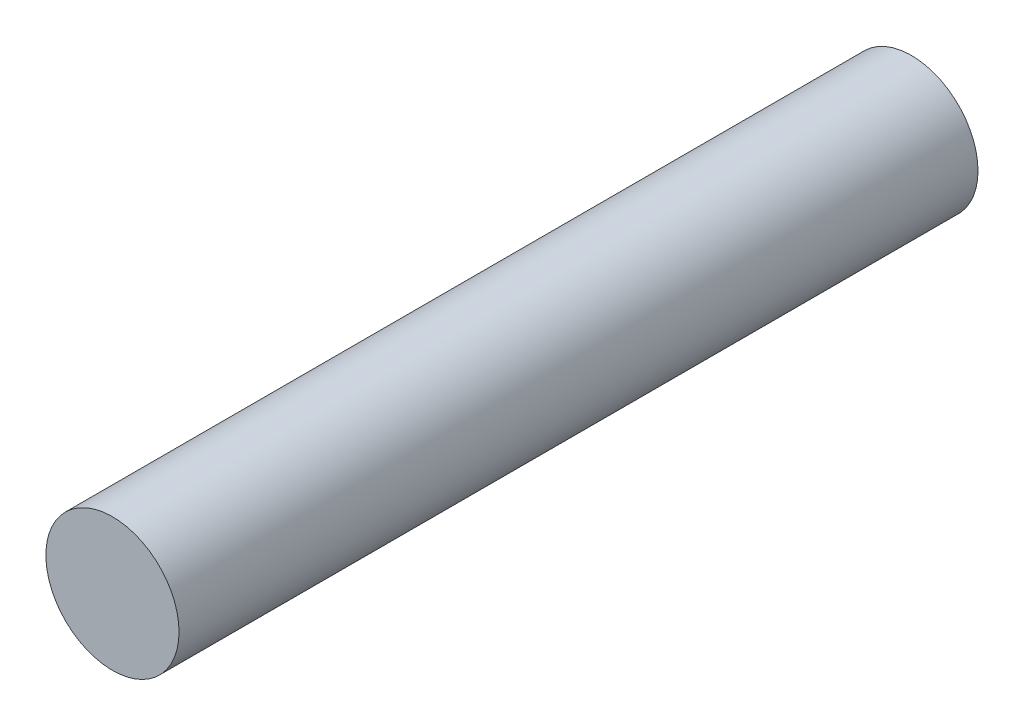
from build123d import *

# Parameters (mm, degrees)
SKETCH2_R          = 50.8
BASE_EXTRUDE_DEPTH = 609.6


with BuildPart() as part:
    # Sketch2 → Base-Extrude (new body)
    with BuildSketch(Plane.XY):
        Circle(SKETCH2_R)
    extrude(amount=-BASE_EXTRUDE_DEPTH)


solid = part.part
